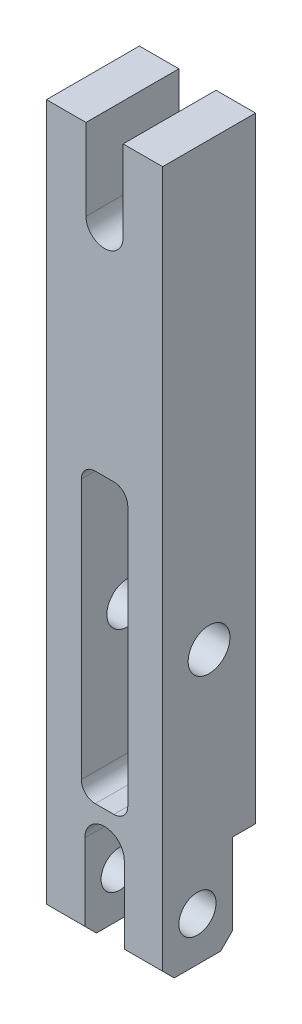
ISO-10303-21;
HEADER;
FILE_DESCRIPTION(('STEP AP214'),'2;1');
FILE_NAME('part.step','',(''),(''),'','','');
FILE_SCHEMA(('AUTOMOTIVE_DESIGN { 1 0 10303 214 1 1 1 1 }'));
ENDSEC;
DATA;
#1=APPLICATION_CONTEXT('core data for automotive mechanical design processes');
#2=APPLICATION_PROTOCOL_DEFINITION('international standard','automotive_design',2000,#1);
#3=PRODUCT_CONTEXT('',#1,'mechanical');
#4=PRODUCT('Part','Part','',(#3));
#5=PRODUCT_RELATED_PRODUCT_CATEGORY('part','',(#4));
#6=PRODUCT_DEFINITION_FORMATION('','',#4);
#7=PRODUCT_DEFINITION_CONTEXT('part definition',#1,'design');
#8=PRODUCT_DEFINITION('design','',#6,#7);
#9=PRODUCT_DEFINITION_SHAPE('','',#8);
#10=(LENGTH_UNIT() NAMED_UNIT(*) SI_UNIT(.MILLI.,.METRE.));
#11=(NAMED_UNIT(*) PLANE_ANGLE_UNIT() SI_UNIT($,.RADIAN.));
#12=(NAMED_UNIT(*) SI_UNIT($,.STERADIAN.) SOLID_ANGLE_UNIT());
#13=UNCERTAINTY_MEASURE_WITH_UNIT(LENGTH_MEASURE(1.E-05),#10,'distance_accuracy_value','');
#14=(GEOMETRIC_REPRESENTATION_CONTEXT(3) GLOBAL_UNCERTAINTY_ASSIGNED_CONTEXT((#13)) GLOBAL_UNIT_ASSIGNED_CONTEXT((#10,
#11,#12)) REPRESENTATION_CONTEXT('',''));
#15=CARTESIAN_POINT('',(0.,0.,0.));
#16=DIRECTION('',(0.,0.,1.));
#17=DIRECTION('',(1.,0.,0.));
#18=AXIS2_PLACEMENT_3D('',#15,#16,#17);
#19=CARTESIAN_POINT('',(0.,-77.,40.));
#20=DIRECTION('',(0.,0.,1.));
#21=DIRECTION('',(1.,0.,0.));
#22=AXIS2_PLACEMENT_3D('',#19,#20,#21);
#23=PLANE('',#22);
#24=DIRECTION('',(0.,-1.,0.));
#25=VECTOR('',#24,1.);
#26=CARTESIAN_POINT('',(-25.,190.,40.));
#27=LINE('',#26,#25);
#28=CARTESIAN_POINT('',(-25.,190.,40.));
#29=VERTEX_POINT('',#28);
#30=CARTESIAN_POINT('',(-25.,-110.,40.));
#31=VERTEX_POINT('',#30);
#32=EDGE_CURVE('E327',#29,#31,#27,.T.);
#33=ORIENTED_EDGE('',*,*,#32,.T.);
#34=DIRECTION('',(1.,0.,0.));
#35=VECTOR('',#34,1.);
#36=CARTESIAN_POINT('',(-8.49999999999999,-110.,40.));
#37=LINE('',#36,#35);
#38=CARTESIAN_POINT('',(-8.49999999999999,-110.,40.));
#39=VERTEX_POINT('',#38);
#40=EDGE_CURVE('E11',#31,#39,#37,.T.);
#41=ORIENTED_EDGE('',*,*,#40,.T.);
#42=DIRECTION('',(0.,1.,0.));
#43=VECTOR('',#42,1.);
#44=CARTESIAN_POINT('',(-8.50000000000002,-77.,40.));
#45=LINE('',#44,#43);
#46=CARTESIAN_POINT('',(-8.5,-77.,40.));
#47=VERTEX_POINT('',#46);
#48=EDGE_CURVE('E330',#39,#47,#45,.T.);
#49=ORIENTED_EDGE('',*,*,#48,.T.);
#50=CARTESIAN_POINT('',(0.,-77.,40.));
#51=DIRECTION('',(0.,0.,-1.));
#52=DIRECTION('',(1.,0.,0.));
#53=AXIS2_PLACEMENT_3D('',#50,#51,#52);
#54=CIRCLE('',#53,8.5);
#55=CARTESIAN_POINT('',(8.49999999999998,-77.,40.));
#56=VERTEX_POINT('',#55);
#57=EDGE_CURVE('E333',#47,#56,#54,.T.);
#58=ORIENTED_EDGE('',*,*,#57,.T.);
#59=DIRECTION('',(0.,-1.,0.));
#60=VECTOR('',#59,1.);
#61=CARTESIAN_POINT('',(8.49999999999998,-77.,40.));
#62=LINE('',#61,#60);
#63=CARTESIAN_POINT('',(8.50000000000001,-110.,40.));
#64=VERTEX_POINT('',#63);
#65=EDGE_CURVE('E335',#56,#64,#62,.T.);
#66=ORIENTED_EDGE('',*,*,#65,.T.);
#67=DIRECTION('',(1.,0.,0.));
#68=VECTOR('',#67,1.);
#69=CARTESIAN_POINT('',(25.,-110.,40.));
#70=LINE('',#69,#68);
#71=CARTESIAN_POINT('',(25.,-110.,40.));
#72=VERTEX_POINT('',#71);
#73=EDGE_CURVE('E40',#64,#72,#70,.T.);
#74=ORIENTED_EDGE('',*,*,#73,.T.);
#75=DIRECTION('',(0.,1.,0.));
#76=VECTOR('',#75,1.);
#77=CARTESIAN_POINT('',(25.,190.,40.));
#78=LINE('',#77,#76);
#79=CARTESIAN_POINT('',(25.,190.,40.));
#80=VERTEX_POINT('',#79);
#81=EDGE_CURVE('E337',#72,#80,#78,.T.);
#82=ORIENTED_EDGE('',*,*,#81,.T.);
#83=DIRECTION('',(-1.,0.,0.));
#84=VECTOR('',#83,1.);
#85=CARTESIAN_POINT('',(8.00000000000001,190.,40.));
#86=LINE('',#85,#84);
#87=CARTESIAN_POINT('',(8.00000000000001,190.,40.));
#88=VERTEX_POINT('',#87);
#89=EDGE_CURVE('E339',#80,#88,#86,.T.);
#90=ORIENTED_EDGE('',*,*,#89,.T.);
#91=DIRECTION('',(0.,-1.,0.));
#92=VECTOR('',#91,1.);
#93=CARTESIAN_POINT('',(8.00000000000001,190.,40.));
#94=LINE('',#93,#92);
#95=CARTESIAN_POINT('',(8.,155.,40.));
#96=VERTEX_POINT('',#95);
#97=EDGE_CURVE('E341',#88,#96,#94,.T.);
#98=ORIENTED_EDGE('',*,*,#97,.T.);
#99=CARTESIAN_POINT('',(0.,155.,40.));
#100=DIRECTION('',(0.,0.,-1.));
#101=DIRECTION('',(1.,0.,0.));
#102=AXIS2_PLACEMENT_3D('',#99,#100,#101);
#103=CIRCLE('',#102,8.);
#104=CARTESIAN_POINT('',(-7.99999999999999,155.,40.));
#105=VERTEX_POINT('',#104);
#106=EDGE_CURVE('E343',#96,#105,#103,.T.);
#107=ORIENTED_EDGE('',*,*,#106,.T.);
#108=DIRECTION('',(0.,1.,0.));
#109=VECTOR('',#108,1.);
#110=CARTESIAN_POINT('',(-7.99999999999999,190.,40.));
#111=LINE('',#110,#109);
#112=CARTESIAN_POINT('',(-7.99999999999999,190.,40.));
#113=VERTEX_POINT('',#112);
#114=EDGE_CURVE('E345',#105,#113,#111,.T.);
#115=ORIENTED_EDGE('',*,*,#114,.T.);
#116=DIRECTION('',(-1.,0.,0.));
#117=VECTOR('',#116,1.);
#118=CARTESIAN_POINT('',(-25.,190.,40.));
#119=LINE('',#118,#117);
#120=EDGE_CURVE('E347',#113,#29,#119,.T.);
#121=ORIENTED_EDGE('',*,*,#120,.T.);
#122=EDGE_LOOP('',(#33,#41,#49,#58,#66,#74,#82,#90,#98,#107,#115,#121));
#123=FACE_BOUND('',#122,.T.);
#124=DIRECTION('',(1.,0.,0.));
#125=VECTOR('',#124,1.);
#126=CARTESIAN_POINT('',(-3.99999999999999,-62.,40.));
#127=LINE('',#126,#125);
#128=CARTESIAN_POINT('',(-3.99999999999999,-62.,40.));
#129=VERTEX_POINT('',#128);
#130=CARTESIAN_POINT('',(4.00000000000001,-62.,40.));
#131=VERTEX_POINT('',#130);
#132=EDGE_CURVE('E270',#129,#131,#127,.T.);
#133=ORIENTED_EDGE('',*,*,#132,.F.);
#134=CARTESIAN_POINT('',(-3.99999999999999,-56.,40.));
#135=DIRECTION('',(0.,0.,1.));
#136=DIRECTION('',(1.,0.,0.));
#137=AXIS2_PLACEMENT_3D('',#134,#135,#136);
#138=CIRCLE('',#137,6.);
#139=CARTESIAN_POINT('',(-9.99999999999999,-56.,40.));
#140=VERTEX_POINT('',#139);
#141=EDGE_CURVE('E268',#140,#129,#138,.T.);
#142=ORIENTED_EDGE('',*,*,#141,.F.);
#143=DIRECTION('',(0.,-1.,0.));
#144=VECTOR('',#143,1.);
#145=CARTESIAN_POINT('',(-10.,56.,40.));
#146=LINE('',#145,#144);
#147=CARTESIAN_POINT('',(-10.,56.,40.));
#148=VERTEX_POINT('',#147);
#149=EDGE_CURVE('E284',#148,#140,#146,.T.);
#150=ORIENTED_EDGE('',*,*,#149,.F.);
#151=CARTESIAN_POINT('',(-4.00000000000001,56.,40.));
#152=DIRECTION('',(0.,0.,1.));
#153=DIRECTION('',(1.,0.,0.));
#154=AXIS2_PLACEMENT_3D('',#151,#152,#153);
#155=CIRCLE('',#154,6.);
#156=CARTESIAN_POINT('',(-4.00000000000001,62.,40.));
#157=VERTEX_POINT('',#156);
#158=EDGE_CURVE('E281',#157,#148,#155,.T.);
#159=ORIENTED_EDGE('',*,*,#158,.F.);
#160=DIRECTION('',(-1.,0.,0.));
#161=VECTOR('',#160,1.);
#162=CARTESIAN_POINT('',(-4.00000000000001,62.,40.));
#163=LINE('',#162,#161);
#164=CARTESIAN_POINT('',(3.99999999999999,62.,40.));
#165=VERTEX_POINT('',#164);
#166=EDGE_CURVE('E279',#165,#157,#163,.T.);
#167=ORIENTED_EDGE('',*,*,#166,.F.);
#168=CARTESIAN_POINT('',(3.99999999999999,56.,40.));
#169=DIRECTION('',(0.,0.,1.));
#170=DIRECTION('',(-1.,0.,0.));
#171=AXIS2_PLACEMENT_3D('',#168,#169,#170);
#172=CIRCLE('',#171,6.);
#173=CARTESIAN_POINT('',(9.99999999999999,56.,40.));
#174=VERTEX_POINT('',#173);
#175=EDGE_CURVE('E277',#174,#165,#172,.T.);
#176=ORIENTED_EDGE('',*,*,#175,.F.);
#177=DIRECTION('',(0.,1.,0.));
#178=VECTOR('',#177,1.);
#179=CARTESIAN_POINT('',(9.99999999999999,56.,40.));
#180=LINE('',#179,#178);
#181=CARTESIAN_POINT('',(10.,-56.,40.));
#182=VERTEX_POINT('',#181);
#183=EDGE_CURVE('E275',#182,#174,#180,.T.);
#184=ORIENTED_EDGE('',*,*,#183,.F.);
#185=CARTESIAN_POINT('',(4.00000000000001,-56.,40.));
#186=DIRECTION('',(0.,0.,1.));
#187=DIRECTION('',(1.,0.,0.));
#188=AXIS2_PLACEMENT_3D('',#185,#186,#187);
#189=CIRCLE('',#188,6.);
#190=EDGE_CURVE('E273',#131,#182,#189,.T.);
#191=ORIENTED_EDGE('',*,*,#190,.F.);
#192=EDGE_LOOP('',(#133,#142,#150,#159,#167,#176,#184,#191));
#193=FACE_BOUND('',#192,.T.);
#194=ADVANCED_FACE('F32',(#123,#193),#23,.T.);
#195=CARTESIAN_POINT('',(0.,-77.,0.));
#196=DIRECTION('',(0.,0.,1.));
#197=DIRECTION('',(1.,0.,0.));
#198=AXIS2_PLACEMENT_3D('',#195,#196,#197);
#199=PLANE('',#198);
#200=DIRECTION('',(0.,1.,0.));
#201=VECTOR('',#200,1.);
#202=CARTESIAN_POINT('',(25.,190.,0.));
#203=LINE('',#202,#201);
#204=CARTESIAN_POINT('',(25.,-75.,0.));
#205=VERTEX_POINT('',#204);
#206=CARTESIAN_POINT('',(25.,190.,0.));
#207=VERTEX_POINT('',#206);
#208=EDGE_CURVE('E354',#205,#207,#203,.T.);
#209=ORIENTED_EDGE('',*,*,#208,.F.);
#210=DIRECTION('',(-1.,0.,0.));
#211=VECTOR('',#210,1.);
#212=CARTESIAN_POINT('',(0.,-75.,0.));
#213=LINE('',#212,#211);
#214=CARTESIAN_POINT('',(8.26135582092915,-75.,0.));
#215=VERTEX_POINT('',#214);
#216=EDGE_CURVE('E265',#205,#215,#213,.T.);
#217=ORIENTED_EDGE('',*,*,#216,.T.);
#218=CARTESIAN_POINT('',(0.,-77.,0.));
#219=DIRECTION('',(0.,0.,-1.));
#220=DIRECTION('',(1.,0.,0.));
#221=AXIS2_PLACEMENT_3D('',#218,#219,#220);
#222=CIRCLE('',#221,8.5);
#223=CARTESIAN_POINT('',(-8.26135582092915,-75.,0.));
#224=VERTEX_POINT('',#223);
#225=EDGE_CURVE('E351',#224,#215,#222,.T.);
#226=ORIENTED_EDGE('',*,*,#225,.F.);
#227=CARTESIAN_POINT('',(-25.,-75.,0.));
#228=VERTEX_POINT('',#227);
#229=EDGE_CURVE('E262',#224,#228,#213,.T.);
#230=ORIENTED_EDGE('',*,*,#229,.T.);
#231=DIRECTION('',(0.,-1.,0.));
#232=VECTOR('',#231,1.);
#233=CARTESIAN_POINT('',(-25.,190.,0.));
#234=LINE('',#233,#232);
#235=CARTESIAN_POINT('',(-25.,190.,0.));
#236=VERTEX_POINT('',#235);
#237=EDGE_CURVE('E247',#236,#228,#234,.T.);
#238=ORIENTED_EDGE('',*,*,#237,.F.);
#239=DIRECTION('',(-1.,0.,0.));
#240=VECTOR('',#239,1.);
#241=CARTESIAN_POINT('',(-25.,190.,0.));
#242=LINE('',#241,#240);
#243=CARTESIAN_POINT('',(-7.99999999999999,190.,0.));
#244=VERTEX_POINT('',#243);
#245=EDGE_CURVE('E331',#244,#236,#242,.T.);
#246=ORIENTED_EDGE('',*,*,#245,.F.);
#247=DIRECTION('',(0.,1.,0.));
#248=VECTOR('',#247,1.);
#249=CARTESIAN_POINT('',(-7.99999999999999,190.,0.));
#250=LINE('',#249,#248);
#251=CARTESIAN_POINT('',(-7.99999999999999,155.,0.));
#252=VERTEX_POINT('',#251);
#253=EDGE_CURVE('E362',#252,#244,#250,.T.);
#254=ORIENTED_EDGE('',*,*,#253,.F.);
#255=CARTESIAN_POINT('',(0.,155.,0.));
#256=DIRECTION('',(0.,0.,-1.));
#257=DIRECTION('',(1.,0.,0.));
#258=AXIS2_PLACEMENT_3D('',#255,#256,#257);
#259=CIRCLE('',#258,8.);
#260=CARTESIAN_POINT('',(8.,155.,0.));
#261=VERTEX_POINT('',#260);
#262=EDGE_CURVE('E360',#261,#252,#259,.T.);
#263=ORIENTED_EDGE('',*,*,#262,.F.);
#264=DIRECTION('',(0.,-1.,0.));
#265=VECTOR('',#264,1.);
#266=CARTESIAN_POINT('',(8.00000000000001,190.,0.));
#267=LINE('',#266,#265);
#268=CARTESIAN_POINT('',(8.00000000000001,190.,0.));
#269=VERTEX_POINT('',#268);
#270=EDGE_CURVE('E358',#269,#261,#267,.T.);
#271=ORIENTED_EDGE('',*,*,#270,.F.);
#272=DIRECTION('',(-1.,0.,0.));
#273=VECTOR('',#272,1.);
#274=CARTESIAN_POINT('',(8.00000000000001,190.,0.));
#275=LINE('',#274,#273);
#276=EDGE_CURVE('E356',#207,#269,#275,.T.);
#277=ORIENTED_EDGE('',*,*,#276,.F.);
#278=EDGE_LOOP('',(#209,#217,#226,#230,#238,#246,#254,#263,#271,#277));
#279=FACE_BOUND('',#278,.T.);
#280=CARTESIAN_POINT('',(-3.99999999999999,-56.,0.));
#281=DIRECTION('',(0.,0.,1.));
#282=DIRECTION('',(1.,0.,0.));
#283=AXIS2_PLACEMENT_3D('',#280,#281,#282);
#284=CIRCLE('',#283,6.);
#285=CARTESIAN_POINT('',(-9.99999999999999,-56.,0.));
#286=VERTEX_POINT('',#285);
#287=CARTESIAN_POINT('',(-3.99999999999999,-62.,0.));
#288=VERTEX_POINT('',#287);
#289=EDGE_CURVE('E287',#286,#288,#284,.T.);
#290=ORIENTED_EDGE('',*,*,#289,.T.);
#291=DIRECTION('',(1.,0.,0.));
#292=VECTOR('',#291,1.);
#293=CARTESIAN_POINT('',(-3.99999999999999,-62.,0.));
#294=LINE('',#293,#292);
#295=CARTESIAN_POINT('',(4.00000000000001,-62.,0.));
#296=VERTEX_POINT('',#295);
#297=EDGE_CURVE('E290',#288,#296,#294,.T.);
#298=ORIENTED_EDGE('',*,*,#297,.T.);
#299=CARTESIAN_POINT('',(4.00000000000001,-56.,0.));
#300=DIRECTION('',(0.,0.,1.));
#301=DIRECTION('',(1.,0.,0.));
#302=AXIS2_PLACEMENT_3D('',#299,#300,#301);
#303=CIRCLE('',#302,6.);
#304=CARTESIAN_POINT('',(10.,-56.,0.));
#305=VERTEX_POINT('',#304);
#306=EDGE_CURVE('E293',#296,#305,#303,.T.);
#307=ORIENTED_EDGE('',*,*,#306,.T.);
#308=DIRECTION('',(0.,1.,0.));
#309=VECTOR('',#308,1.);
#310=CARTESIAN_POINT('',(9.99999999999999,56.,0.));
#311=LINE('',#310,#309);
#312=CARTESIAN_POINT('',(9.99999999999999,56.,0.));
#313=VERTEX_POINT('',#312);
#314=EDGE_CURVE('E296',#305,#313,#311,.T.);
#315=ORIENTED_EDGE('',*,*,#314,.T.);
#316=CARTESIAN_POINT('',(3.99999999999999,56.,0.));
#317=DIRECTION('',(0.,0.,1.));
#318=DIRECTION('',(-1.,0.,0.));
#319=AXIS2_PLACEMENT_3D('',#316,#317,#318);
#320=CIRCLE('',#319,6.);
#321=CARTESIAN_POINT('',(3.99999999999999,62.,0.));
#322=VERTEX_POINT('',#321);
#323=EDGE_CURVE('E299',#313,#322,#320,.T.);
#324=ORIENTED_EDGE('',*,*,#323,.T.);
#325=DIRECTION('',(-1.,0.,0.));
#326=VECTOR('',#325,1.);
#327=CARTESIAN_POINT('',(-4.00000000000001,62.,0.));
#328=LINE('',#327,#326);
#329=CARTESIAN_POINT('',(-4.00000000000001,62.,0.));
#330=VERTEX_POINT('',#329);
#331=EDGE_CURVE('E302',#322,#330,#328,.T.);
#332=ORIENTED_EDGE('',*,*,#331,.T.);
#333=CARTESIAN_POINT('',(-4.00000000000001,56.,0.));
#334=DIRECTION('',(0.,0.,1.));
#335=DIRECTION('',(1.,0.,0.));
#336=AXIS2_PLACEMENT_3D('',#333,#334,#335);
#337=CIRCLE('',#336,6.);
#338=CARTESIAN_POINT('',(-10.,56.,0.));
#339=VERTEX_POINT('',#338);
#340=EDGE_CURVE('E305',#330,#339,#337,.T.);
#341=ORIENTED_EDGE('',*,*,#340,.T.);
#342=DIRECTION('',(0.,-1.,0.));
#343=VECTOR('',#342,1.);
#344=CARTESIAN_POINT('',(-10.,56.,0.));
#345=LINE('',#344,#343);
#346=EDGE_CURVE('E271',#339,#286,#345,.T.);
#347=ORIENTED_EDGE('',*,*,#346,.T.);
#348=EDGE_LOOP('',(#290,#298,#307,#315,#324,#332,#341,#347));
#349=FACE_BOUND('',#348,.T.);
#350=ADVANCED_FACE('F499',(#279,#349),#199,.F.);
#351=CARTESIAN_POINT('',(-25.,190.,40.));
#352=DIRECTION('',(1.,0.,0.));
#353=DIRECTION('',(0.,1.,0.));
#354=AXIS2_PLACEMENT_3D('',#351,#352,#353);
#355=PLANE('',#354);
#356=CARTESIAN_POINT('',(-25.,0.,20.));
#357=DIRECTION('',(-1.,0.,0.));
#358=DIRECTION('',(0.,-1.,0.));
#359=AXIS2_PLACEMENT_3D('',#356,#357,#358);
#360=CIRCLE('',#359,9.00000000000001);
#361=CARTESIAN_POINT('',(-25.,-9.00000000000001,20.));
#362=VERTEX_POINT('',#361);
#363=EDGE_CURVE('E797',#362,#362,#360,.T.);
#364=ORIENTED_EDGE('',*,*,#363,.F.);
#365=EDGE_LOOP('',(#364));
#366=FACE_BOUND('',#365,.T.);
#367=CARTESIAN_POINT('',(-25.,-96.,25.));
#368=DIRECTION('',(-1.,0.,0.));
#369=DIRECTION('',(0.,-1.,0.));
#370=AXIS2_PLACEMENT_3D('',#367,#368,#369);
#371=CIRCLE('',#370,8.);
#372=CARTESIAN_POINT('',(-25.,-104.,25.));
#373=VERTEX_POINT('',#372);
#374=EDGE_CURVE('E532',#373,#373,#371,.T.);
#375=ORIENTED_EDGE('',*,*,#374,.F.);
#376=EDGE_LOOP('',(#375));
#377=FACE_BOUND('',#376,.T.);
#378=DIRECTION('',(0.,1.,0.));
#379=VECTOR('',#378,1.);
#380=CARTESIAN_POINT('',(-25.,-75.,10.));
#381=LINE('',#380,#379);
#382=CARTESIAN_POINT('',(-25.,-110.,10.));
#383=VERTEX_POINT('',#382);
#384=CARTESIAN_POINT('',(-25.,-75.,10.));
#385=VERTEX_POINT('',#384);
#386=EDGE_CURVE('E219',#383,#385,#381,.T.);
#387=ORIENTED_EDGE('',*,*,#386,.F.);
#388=DIRECTION('',(0.,0.707106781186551,-0.707106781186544));
#389=VECTOR('',#388,1.);
#390=CARTESIAN_POINT('',(-25.,-115.,15.));
#391=LINE('',#390,#389);
#392=CARTESIAN_POINT('',(-25.,-115.,15.));
#393=VERTEX_POINT('',#392);
#394=EDGE_CURVE('E418',#383,#393,#391,.F.);
#395=ORIENTED_EDGE('',*,*,#394,.T.);
#396=DIRECTION('',(0.,0.,-1.));
#397=VECTOR('',#396,1.);
#398=CARTESIAN_POINT('',(-25.,-115.,40.));
#399=LINE('',#398,#397);
#400=CARTESIAN_POINT('',(-25.,-115.,35.));
#401=VERTEX_POINT('',#400);
#402=EDGE_CURVE('E396',#401,#393,#399,.T.);
#403=ORIENTED_EDGE('',*,*,#402,.F.);
#404=DIRECTION('',(0.,0.707106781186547,0.707106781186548));
#405=VECTOR('',#404,1.);
#406=CARTESIAN_POINT('',(-25.,-110.,40.));
#407=LINE('',#406,#405);
#408=EDGE_CURVE('E416',#401,#31,#407,.T.);
#409=ORIENTED_EDGE('',*,*,#408,.T.);
#410=ORIENTED_EDGE('',*,*,#32,.F.);
#411=DIRECTION('',(0.,0.,-1.));
#412=VECTOR('',#411,1.);
#413=CARTESIAN_POINT('',(-25.,190.,40.));
#414=LINE('',#413,#412);
#415=EDGE_CURVE('E349',#29,#236,#414,.T.);
#416=ORIENTED_EDGE('',*,*,#415,.T.);
#417=ORIENTED_EDGE('',*,*,#237,.T.);
#418=DIRECTION('',(0.,0.,-1.));
#419=VECTOR('',#418,1.);
#420=CARTESIAN_POINT('',(-25.,-75.,-20.));
#421=LINE('',#420,#419);
#422=EDGE_CURVE('E231',#385,#228,#421,.T.);
#423=ORIENTED_EDGE('',*,*,#422,.F.);
#424=EDGE_LOOP('',(#387,#395,#403,#409,#410,#416,#417,#423));
#425=FACE_BOUND('',#424,.T.);
#426=ADVANCED_FACE('F244',(#366,#377,#425),#355,.F.);
#427=CARTESIAN_POINT('',(-25.,-115.,40.));
#428=DIRECTION('',(0.,1.,0.));
#429=DIRECTION('',(-1.,0.,0.));
#430=AXIS2_PLACEMENT_3D('',#427,#428,#429);
#431=PLANE('',#430);
#432=ORIENTED_EDGE('',*,*,#402,.T.);
#433=DIRECTION('',(1.,0.,0.));
#434=VECTOR('',#433,1.);
#435=CARTESIAN_POINT('',(-25.,-115.,15.));
#436=LINE('',#435,#434);
#437=CARTESIAN_POINT('',(-8.49999999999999,-115.,15.));
#438=VERTEX_POINT('',#437);
#439=EDGE_CURVE('E408',#393,#438,#436,.T.);
#440=ORIENTED_EDGE('',*,*,#439,.T.);
#441=DIRECTION('',(0.,0.,-1.));
#442=VECTOR('',#441,1.);
#443=CARTESIAN_POINT('',(-8.49999999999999,-115.,40.));
#444=LINE('',#443,#442);
#445=CARTESIAN_POINT('',(-8.49999999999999,-115.,35.));
#446=VERTEX_POINT('',#445);
#447=EDGE_CURVE('E393',#446,#438,#444,.T.);
#448=ORIENTED_EDGE('',*,*,#447,.F.);
#449=DIRECTION('',(-1.,0.,0.));
#450=VECTOR('',#449,1.);
#451=CARTESIAN_POINT('',(-25.,-115.,35.));
#452=LINE('',#451,#450);
#453=EDGE_CURVE('E401',#446,#401,#452,.T.);
#454=ORIENTED_EDGE('',*,*,#453,.T.);
#455=EDGE_LOOP('',(#432,#440,#448,#454));
#456=FACE_BOUND('',#455,.T.);
#457=ADVANCED_FACE('F782',(#456),#431,.F.);
#458=CARTESIAN_POINT('',(-8.50000000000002,-77.,40.));
#459=DIRECTION('',(-1.,0.,0.));
#460=DIRECTION('',(0.,-1.,0.));
#461=AXIS2_PLACEMENT_3D('',#458,#459,#460);
#462=PLANE('',#461);
#463=CARTESIAN_POINT('',(-8.50000000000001,-96.,25.));
#464=DIRECTION('',(-1.,0.,0.));
#465=DIRECTION('',(0.,-1.,0.));
#466=AXIS2_PLACEMENT_3D('',#463,#464,#465);
#467=CIRCLE('',#466,8.);
#468=CARTESIAN_POINT('',(-8.5,-104.,25.));
#469=VERTEX_POINT('',#468);
#470=EDGE_CURVE('E232',#469,#469,#467,.T.);
#471=ORIENTED_EDGE('',*,*,#470,.T.);
#472=EDGE_LOOP('',(#471));
#473=FACE_BOUND('',#472,.T.);
#474=ORIENTED_EDGE('',*,*,#447,.T.);
#475=DIRECTION('',(0.,-0.707106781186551,0.707106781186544));
#476=VECTOR('',#475,1.);
#477=CARTESIAN_POINT('',(-8.49999999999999,-115.,14.9999999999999));
#478=LINE('',#477,#476);
#479=CARTESIAN_POINT('',(-8.49999999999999,-110.,10.));
#480=VERTEX_POINT('',#479);
#481=EDGE_CURVE('E413',#438,#480,#478,.F.);
#482=ORIENTED_EDGE('',*,*,#481,.T.);
#483=DIRECTION('',(0.,1.,0.));
#484=VECTOR('',#483,1.);
#485=CARTESIAN_POINT('',(-8.50000000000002,-77.,10.));
#486=LINE('',#485,#484);
#487=CARTESIAN_POINT('',(-8.5,-77.,10.));
#488=VERTEX_POINT('',#487);
#489=EDGE_CURVE('E259',#480,#488,#486,.T.);
#490=ORIENTED_EDGE('',*,*,#489,.T.);
#491=DIRECTION('',(0.,0.,-1.));
#492=VECTOR('',#491,1.);
#493=CARTESIAN_POINT('',(-8.5,-77.,40.));
#494=LINE('',#493,#492);
#495=EDGE_CURVE('E390',#47,#488,#494,.T.);
#496=ORIENTED_EDGE('',*,*,#495,.F.);
#497=ORIENTED_EDGE('',*,*,#48,.F.);
#498=DIRECTION('',(0.,-0.707106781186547,-0.707106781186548));
#499=VECTOR('',#498,1.);
#500=CARTESIAN_POINT('',(-8.49999999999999,-110.,40.));
#501=LINE('',#500,#499);
#502=EDGE_CURVE('E411',#39,#446,#501,.T.);
#503=ORIENTED_EDGE('',*,*,#502,.T.);
#504=EDGE_LOOP('',(#474,#482,#490,#496,#497,#503));
#505=FACE_BOUND('',#504,.T.);
#506=ADVANCED_FACE('F478',(#473,#505),#462,.F.);
#507=CARTESIAN_POINT('',(0.,-77.,40.));
#508=DIRECTION('',(0.,0.,-1.));
#509=DIRECTION('',(-1.,0.,0.));
#510=AXIS2_PLACEMENT_3D('',#507,#508,#509);
#511=CYLINDRICAL_SURFACE('',#510,8.5);
#512=ORIENTED_EDGE('',*,*,#225,.T.);
#513=DIRECTION('',(0.,0.,-1.));
#514=VECTOR('',#513,1.);
#515=CARTESIAN_POINT('',(8.26135582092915,-75.,40.));
#516=LINE('',#515,#514);
#517=CARTESIAN_POINT('',(8.26135582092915,-75.,10.));
#518=VERTEX_POINT('',#517);
#519=EDGE_CURVE('E264',#215,#518,#516,.F.);
#520=ORIENTED_EDGE('',*,*,#519,.T.);
#521=CARTESIAN_POINT('',(0.,-77.,10.));
#522=DIRECTION('',(0.,0.,1.));
#523=DIRECTION('',(0.,-1.,0.));
#524=AXIS2_PLACEMENT_3D('',#521,#522,#523);
#525=CIRCLE('',#524,8.5);
#526=CARTESIAN_POINT('',(8.49999999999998,-77.,10.));
#527=VERTEX_POINT('',#526);
#528=EDGE_CURVE('E255',#518,#527,#525,.F.);
#529=ORIENTED_EDGE('',*,*,#528,.T.);
#530=DIRECTION('',(0.,0.,-1.));
#531=VECTOR('',#530,1.);
#532=CARTESIAN_POINT('',(8.49999999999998,-77.,40.));
#533=LINE('',#532,#531);
#534=EDGE_CURVE('E387',#56,#527,#533,.T.);
#535=ORIENTED_EDGE('',*,*,#534,.F.);
#536=ORIENTED_EDGE('',*,*,#57,.F.);
#537=ORIENTED_EDGE('',*,*,#495,.T.);
#538=CARTESIAN_POINT('',(-8.26135582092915,-75.,10.));
#539=VERTEX_POINT('',#538);
#540=EDGE_CURVE('E258',#488,#539,#525,.F.);
#541=ORIENTED_EDGE('',*,*,#540,.T.);
#542=DIRECTION('',(0.,0.,-1.));
#543=VECTOR('',#542,1.);
#544=CARTESIAN_POINT('',(-8.26135582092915,-75.,40.));
#545=LINE('',#544,#543);
#546=EDGE_CURVE('E238',#539,#224,#545,.T.);
#547=ORIENTED_EDGE('',*,*,#546,.T.);
#548=EDGE_LOOP('',(#512,#520,#529,#535,#536,#537,#541,#547));
#549=FACE_BOUND('',#548,.T.);
#550=ADVANCED_FACE('F483',(#549),#511,.F.);
#551=CARTESIAN_POINT('',(8.49999999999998,-77.,40.));
#552=DIRECTION('',(1.,0.,0.));
#553=DIRECTION('',(0.,1.,0.));
#554=AXIS2_PLACEMENT_3D('',#551,#552,#553);
#555=PLANE('',#554);
#556=CARTESIAN_POINT('',(8.5,-96.,25.));
#557=DIRECTION('',(1.,0.,0.));
#558=DIRECTION('',(0.,1.,0.));
#559=AXIS2_PLACEMENT_3D('',#556,#557,#558);
#560=CIRCLE('',#559,8.);
#561=CARTESIAN_POINT('',(8.49999999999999,-88.,25.));
#562=VERTEX_POINT('',#561);
#563=EDGE_CURVE('E531',#562,#562,#560,.T.);
#564=ORIENTED_EDGE('',*,*,#563,.T.);
#565=EDGE_LOOP('',(#564));
#566=FACE_BOUND('',#565,.T.);
#567=DIRECTION('',(0.,-1.,0.));
#568=VECTOR('',#567,1.);
#569=CARTESIAN_POINT('',(8.49999999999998,-77.,10.));
#570=LINE('',#569,#568);
#571=CARTESIAN_POINT('',(8.50000000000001,-110.,10.));
#572=VERTEX_POINT('',#571);
#573=EDGE_CURVE('E253',#527,#572,#570,.T.);
#574=ORIENTED_EDGE('',*,*,#573,.T.);
#575=DIRECTION('',(0.,0.707106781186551,-0.707106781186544));
#576=VECTOR('',#575,1.);
#577=CARTESIAN_POINT('',(8.50000000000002,-115.,15.));
#578=LINE('',#577,#576);
#579=CARTESIAN_POINT('',(8.50000000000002,-115.,15.));
#580=VERTEX_POINT('',#579);
#581=EDGE_CURVE('E431',#572,#580,#578,.F.);
#582=ORIENTED_EDGE('',*,*,#581,.T.);
#583=DIRECTION('',(0.,0.,-1.));
#584=VECTOR('',#583,1.);
#585=CARTESIAN_POINT('',(8.50000000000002,-115.,40.));
#586=LINE('',#585,#584);
#587=CARTESIAN_POINT('',(8.50000000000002,-115.,35.));
#588=VERTEX_POINT('',#587);
#589=EDGE_CURVE('E384',#588,#580,#586,.T.);
#590=ORIENTED_EDGE('',*,*,#589,.F.);
#591=DIRECTION('',(0.,0.707106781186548,0.707106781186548));
#592=VECTOR('',#591,1.);
#593=CARTESIAN_POINT('',(8.50000000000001,-110.,40.));
#594=LINE('',#593,#592);
#595=EDGE_CURVE('E47',#588,#64,#594,.T.);
#596=ORIENTED_EDGE('',*,*,#595,.T.);
#597=ORIENTED_EDGE('',*,*,#65,.F.);
#598=ORIENTED_EDGE('',*,*,#534,.T.);
#599=EDGE_LOOP('',(#574,#582,#590,#596,#597,#598));
#600=FACE_BOUND('',#599,.T.);
#601=ADVANCED_FACE('F484',(#566,#600),#555,.F.);
#602=CARTESIAN_POINT('',(8.50000000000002,-115.,40.));
#603=DIRECTION('',(0.,1.,0.));
#604=DIRECTION('',(0.,0.,1.));
#605=AXIS2_PLACEMENT_3D('',#602,#603,#604);
#606=PLANE('',#605);
#607=ORIENTED_EDGE('',*,*,#589,.T.);
#608=DIRECTION('',(1.,0.,0.));
#609=VECTOR('',#608,1.);
#610=CARTESIAN_POINT('',(8.50000000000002,-115.,15.));
#611=LINE('',#610,#609);
#612=CARTESIAN_POINT('',(25.,-115.,15.));
#613=VERTEX_POINT('',#612);
#614=EDGE_CURVE('E422',#580,#613,#611,.T.);
#615=ORIENTED_EDGE('',*,*,#614,.T.);
#616=DIRECTION('',(0.,0.,-1.));
#617=VECTOR('',#616,1.);
#618=CARTESIAN_POINT('',(25.,-115.,40.));
#619=LINE('',#618,#617);
#620=CARTESIAN_POINT('',(25.,-115.,35.));
#621=VERTEX_POINT('',#620);
#622=EDGE_CURVE('E381',#621,#613,#619,.T.);
#623=ORIENTED_EDGE('',*,*,#622,.F.);
#624=DIRECTION('',(-1.,0.,0.));
#625=VECTOR('',#624,1.);
#626=CARTESIAN_POINT('',(8.50000000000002,-115.,35.));
#627=LINE('',#626,#625);
#628=EDGE_CURVE('E420',#621,#588,#627,.T.);
#629=ORIENTED_EDGE('',*,*,#628,.T.);
#630=EDGE_LOOP('',(#607,#615,#623,#629));
#631=FACE_BOUND('',#630,.T.);
#632=ADVANCED_FACE('F487',(#631),#606,.F.);
#633=CARTESIAN_POINT('',(25.,190.,40.));
#634=DIRECTION('',(-1.,0.,0.));
#635=DIRECTION('',(0.,-1.,0.));
#636=AXIS2_PLACEMENT_3D('',#633,#634,#635);
#637=PLANE('',#636);
#638=CARTESIAN_POINT('',(25.0000000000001,0.,20.));
#639=DIRECTION('',(-1.,0.,0.));
#640=DIRECTION('',(0.,-1.,0.));
#641=AXIS2_PLACEMENT_3D('',#638,#639,#640);
#642=CIRCLE('',#641,9.00000000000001);
#643=CARTESIAN_POINT('',(25.0000000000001,-9.,20.));
#644=VERTEX_POINT('',#643);
#645=EDGE_CURVE('E406',#644,#644,#642,.T.);
#646=ORIENTED_EDGE('',*,*,#645,.T.);
#647=EDGE_LOOP('',(#646));
#648=FACE_BOUND('',#647,.T.);
#649=CARTESIAN_POINT('',(25.0000000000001,-96.,25.));
#650=DIRECTION('',(-1.,0.,0.));
#651=DIRECTION('',(0.,-1.,0.));
#652=AXIS2_PLACEMENT_3D('',#649,#650,#651);
#653=CIRCLE('',#652,8.);
#654=CARTESIAN_POINT('',(25.0000000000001,-104.,25.));
#655=VERTEX_POINT('',#654);
#656=EDGE_CURVE('E529',#655,#655,#653,.T.);
#657=ORIENTED_EDGE('',*,*,#656,.T.);
#658=EDGE_LOOP('',(#657));
#659=FACE_BOUND('',#658,.T.);
#660=ORIENTED_EDGE('',*,*,#622,.T.);
#661=DIRECTION('',(0.,-0.707106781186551,0.707106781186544));
#662=VECTOR('',#661,1.);
#663=CARTESIAN_POINT('',(25.,-115.,15.));
#664=LINE('',#663,#662);
#665=CARTESIAN_POINT('',(25.,-110.,10.));
#666=VERTEX_POINT('',#665);
#667=EDGE_CURVE('E427',#613,#666,#664,.F.);
#668=ORIENTED_EDGE('',*,*,#667,.T.);
#669=DIRECTION('',(0.,1.,0.));
#670=VECTOR('',#669,1.);
#671=CARTESIAN_POINT('',(25.,190.,9.99999999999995));
#672=LINE('',#671,#670);
#673=CARTESIAN_POINT('',(25.,-75.,10.));
#674=VERTEX_POINT('',#673);
#675=EDGE_CURVE('E399',#666,#674,#672,.T.);
#676=ORIENTED_EDGE('',*,*,#675,.T.);
#677=DIRECTION('',(0.,0.,-1.));
#678=VECTOR('',#677,1.);
#679=CARTESIAN_POINT('',(25.,-75.,-20.));
#680=LINE('',#679,#678);
#681=EDGE_CURVE('E241',#674,#205,#680,.T.);
#682=ORIENTED_EDGE('',*,*,#681,.T.);
#683=ORIENTED_EDGE('',*,*,#208,.T.);
#684=DIRECTION('',(0.,0.,-1.));
#685=VECTOR('',#684,1.);
#686=CARTESIAN_POINT('',(25.,190.,40.));
#687=LINE('',#686,#685);
#688=EDGE_CURVE('E378',#80,#207,#687,.T.);
#689=ORIENTED_EDGE('',*,*,#688,.F.);
#690=ORIENTED_EDGE('',*,*,#81,.F.);
#691=DIRECTION('',(0.,-0.707106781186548,-0.707106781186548));
#692=VECTOR('',#691,1.);
#693=CARTESIAN_POINT('',(25.,-110.,40.));
#694=LINE('',#693,#692);
#695=EDGE_CURVE('E425',#72,#621,#694,.T.);
#696=ORIENTED_EDGE('',*,*,#695,.T.);
#697=EDGE_LOOP('',(#660,#668,#676,#682,#683,#689,#690,#696));
#698=FACE_BOUND('',#697,.T.);
#699=ADVANCED_FACE('F440',(#648,#659,#698),#637,.F.);
#700=CARTESIAN_POINT('',(8.00000000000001,190.,40.));
#701=DIRECTION('',(0.,-1.,0.));
#702=DIRECTION('',(0.,0.,-1.));
#703=AXIS2_PLACEMENT_3D('',#700,#701,#702);
#704=PLANE('',#703);
#705=ORIENTED_EDGE('',*,*,#276,.T.);
#706=DIRECTION('',(0.,0.,-1.));
#707=VECTOR('',#706,1.);
#708=CARTESIAN_POINT('',(8.00000000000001,190.,40.));
#709=LINE('',#708,#707);
#710=EDGE_CURVE('E375',#88,#269,#709,.T.);
#711=ORIENTED_EDGE('',*,*,#710,.F.);
#712=ORIENTED_EDGE('',*,*,#89,.F.);
#713=ORIENTED_EDGE('',*,*,#688,.T.);
#714=EDGE_LOOP('',(#705,#711,#712,#713));
#715=FACE_BOUND('',#714,.T.);
#716=ADVANCED_FACE('F447',(#715),#704,.F.);
#717=CARTESIAN_POINT('',(8.00000000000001,190.,40.));
#718=DIRECTION('',(1.,0.,0.));
#719=DIRECTION('',(0.,1.,0.));
#720=AXIS2_PLACEMENT_3D('',#717,#718,#719);
#721=PLANE('',#720);
#722=ORIENTED_EDGE('',*,*,#270,.T.);
#723=DIRECTION('',(0.,0.,-1.));
#724=VECTOR('',#723,1.);
#725=CARTESIAN_POINT('',(8.,155.,40.));
#726=LINE('',#725,#724);
#727=EDGE_CURVE('E372',#96,#261,#726,.T.);
#728=ORIENTED_EDGE('',*,*,#727,.F.);
#729=ORIENTED_EDGE('',*,*,#97,.F.);
#730=ORIENTED_EDGE('',*,*,#710,.T.);
#731=EDGE_LOOP('',(#722,#728,#729,#730));
#732=FACE_BOUND('',#731,.T.);
#733=ADVANCED_FACE('F453',(#732),#721,.F.);
#734=CARTESIAN_POINT('',(0.,155.,40.));
#735=DIRECTION('',(0.,0.,-1.));
#736=DIRECTION('',(-1.,0.,0.));
#737=AXIS2_PLACEMENT_3D('',#734,#735,#736);
#738=CYLINDRICAL_SURFACE('',#737,8.);
#739=ORIENTED_EDGE('',*,*,#262,.T.);
#740=DIRECTION('',(0.,0.,-1.));
#741=VECTOR('',#740,1.);
#742=CARTESIAN_POINT('',(-7.99999999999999,155.,40.));
#743=LINE('',#742,#741);
#744=EDGE_CURVE('E369',#105,#252,#743,.T.);
#745=ORIENTED_EDGE('',*,*,#744,.F.);
#746=ORIENTED_EDGE('',*,*,#106,.F.);
#747=ORIENTED_EDGE('',*,*,#727,.T.);
#748=EDGE_LOOP('',(#739,#745,#746,#747));
#749=FACE_BOUND('',#748,.T.);
#750=ADVANCED_FACE('F457',(#749),#738,.F.);
#751=CARTESIAN_POINT('',(-7.99999999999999,190.,40.));
#752=DIRECTION('',(-1.,0.,0.));
#753=DIRECTION('',(0.,-1.,0.));
#754=AXIS2_PLACEMENT_3D('',#751,#752,#753);
#755=PLANE('',#754);
#756=ORIENTED_EDGE('',*,*,#253,.T.);
#757=DIRECTION('',(0.,0.,-1.));
#758=VECTOR('',#757,1.);
#759=CARTESIAN_POINT('',(-7.99999999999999,190.,40.));
#760=LINE('',#759,#758);
#761=EDGE_CURVE('E366',#113,#244,#760,.T.);
#762=ORIENTED_EDGE('',*,*,#761,.F.);
#763=ORIENTED_EDGE('',*,*,#114,.F.);
#764=ORIENTED_EDGE('',*,*,#744,.T.);
#765=EDGE_LOOP('',(#756,#762,#763,#764));
#766=FACE_BOUND('',#765,.T.);
#767=ADVANCED_FACE('F462',(#766),#755,.F.);
#768=CARTESIAN_POINT('',(-25.,190.,40.));
#769=DIRECTION('',(0.,-1.,0.));
#770=DIRECTION('',(0.,0.,-1.));
#771=AXIS2_PLACEMENT_3D('',#768,#769,#770);
#772=PLANE('',#771);
#773=ORIENTED_EDGE('',*,*,#245,.T.);
#774=ORIENTED_EDGE('',*,*,#415,.F.);
#775=ORIENTED_EDGE('',*,*,#120,.F.);
#776=ORIENTED_EDGE('',*,*,#761,.T.);
#777=EDGE_LOOP('',(#773,#774,#775,#776));
#778=FACE_BOUND('',#777,.T.);
#779=ADVANCED_FACE('F468',(#778),#772,.F.);
#780=CARTESIAN_POINT('',(-3.99999999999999,-56.,40.));
#781=DIRECTION('',(0.,0.,-1.));
#782=DIRECTION('',(-1.,0.,0.));
#783=AXIS2_PLACEMENT_3D('',#780,#781,#782);
#784=CYLINDRICAL_SURFACE('',#783,6.);
#785=ORIENTED_EDGE('',*,*,#289,.F.);
#786=DIRECTION('',(0.,0.,-1.));
#787=VECTOR('',#786,1.);
#788=CARTESIAN_POINT('',(-9.99999999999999,-56.,40.));
#789=LINE('',#788,#787);
#790=EDGE_CURVE('E286',#140,#286,#789,.T.);
#791=ORIENTED_EDGE('',*,*,#790,.F.);
#792=ORIENTED_EDGE('',*,*,#141,.T.);
#793=DIRECTION('',(0.,0.,-1.));
#794=VECTOR('',#793,1.);
#795=CARTESIAN_POINT('',(-3.99999999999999,-62.,40.));
#796=LINE('',#795,#794);
#797=EDGE_CURVE('E324',#129,#288,#796,.T.);
#798=ORIENTED_EDGE('',*,*,#797,.T.);
#799=EDGE_LOOP('',(#785,#791,#792,#798));
#800=FACE_BOUND('',#799,.T.);
#801=ADVANCED_FACE('F507',(#800),#784,.F.);
#802=CARTESIAN_POINT('',(-3.99999999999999,-62.,40.));
#803=DIRECTION('',(0.,1.,0.));
#804=DIRECTION('',(0.,0.,1.));
#805=AXIS2_PLACEMENT_3D('',#802,#803,#804);
#806=PLANE('',#805);
#807=ORIENTED_EDGE('',*,*,#297,.F.);
#808=ORIENTED_EDGE('',*,*,#797,.F.);
#809=ORIENTED_EDGE('',*,*,#132,.T.);
#810=DIRECTION('',(0.,0.,-1.));
#811=VECTOR('',#810,1.);
#812=CARTESIAN_POINT('',(4.00000000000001,-62.,40.));
#813=LINE('',#812,#811);
#814=EDGE_CURVE('E322',#131,#296,#813,.T.);
#815=ORIENTED_EDGE('',*,*,#814,.T.);
#816=EDGE_LOOP('',(#807,#808,#809,#815));
#817=FACE_BOUND('',#816,.T.);
#818=ADVANCED_FACE('F587',(#817),#806,.T.);
#819=CARTESIAN_POINT('',(4.00000000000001,-56.,40.));
#820=DIRECTION('',(0.,0.,-1.));
#821=DIRECTION('',(-1.,0.,0.));
#822=AXIS2_PLACEMENT_3D('',#819,#820,#821);
#823=CYLINDRICAL_SURFACE('',#822,6.);
#824=ORIENTED_EDGE('',*,*,#306,.F.);
#825=ORIENTED_EDGE('',*,*,#814,.F.);
#826=ORIENTED_EDGE('',*,*,#190,.T.);
#827=DIRECTION('',(0.,0.,-1.));
#828=VECTOR('',#827,1.);
#829=CARTESIAN_POINT('',(10.,-56.,40.));
#830=LINE('',#829,#828);
#831=EDGE_CURVE('E320',#182,#305,#830,.T.);
#832=ORIENTED_EDGE('',*,*,#831,.T.);
#833=EDGE_LOOP('',(#824,#825,#826,#832));
#834=FACE_BOUND('',#833,.T.);
#835=ADVANCED_FACE('F584',(#834),#823,.F.);
#836=CARTESIAN_POINT('',(9.99999999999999,56.,40.));
#837=DIRECTION('',(-1.,0.,0.));
#838=DIRECTION('',(0.,-1.,0.));
#839=AXIS2_PLACEMENT_3D('',#836,#837,#838);
#840=PLANE('',#839);
#841=CARTESIAN_POINT('',(10.,0.,20.));
#842=DIRECTION('',(-1.,0.,0.));
#843=DIRECTION('',(0.,-1.,0.));
#844=AXIS2_PLACEMENT_3D('',#841,#842,#843);
#845=CIRCLE('',#844,9.00000000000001);
#846=CARTESIAN_POINT('',(10.,-9.00000000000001,20.));
#847=VERTEX_POINT('',#846);
#848=EDGE_CURVE('E405',#847,#847,#845,.T.);
#849=ORIENTED_EDGE('',*,*,#848,.F.);
#850=EDGE_LOOP('',(#849));
#851=FACE_BOUND('',#850,.T.);
#852=ORIENTED_EDGE('',*,*,#314,.F.);
#853=ORIENTED_EDGE('',*,*,#831,.F.);
#854=ORIENTED_EDGE('',*,*,#183,.T.);
#855=DIRECTION('',(0.,0.,-1.));
#856=VECTOR('',#855,1.);
#857=CARTESIAN_POINT('',(9.99999999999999,56.,40.));
#858=LINE('',#857,#856);
#859=EDGE_CURVE('E318',#174,#313,#858,.T.);
#860=ORIENTED_EDGE('',*,*,#859,.T.);
#861=EDGE_LOOP('',(#852,#853,#854,#860));
#862=FACE_BOUND('',#861,.T.);
#863=ADVANCED_FACE('F580',(#851,#862),#840,.T.);
#864=CARTESIAN_POINT('',(3.99999999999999,56.,40.));
#865=DIRECTION('',(0.,0.,-1.));
#866=DIRECTION('',(-1.,0.,0.));
#867=AXIS2_PLACEMENT_3D('',#864,#865,#866);
#868=CYLINDRICAL_SURFACE('',#867,6.);
#869=ORIENTED_EDGE('',*,*,#323,.F.);
#870=ORIENTED_EDGE('',*,*,#859,.F.);
#871=ORIENTED_EDGE('',*,*,#175,.T.);
#872=DIRECTION('',(0.,0.,-1.));
#873=VECTOR('',#872,1.);
#874=CARTESIAN_POINT('',(3.99999999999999,62.,40.));
#875=LINE('',#874,#873);
#876=EDGE_CURVE('E316',#165,#322,#875,.T.);
#877=ORIENTED_EDGE('',*,*,#876,.T.);
#878=EDGE_LOOP('',(#869,#870,#871,#877));
#879=FACE_BOUND('',#878,.T.);
#880=ADVANCED_FACE('F576',(#879),#868,.F.);
#881=CARTESIAN_POINT('',(-4.00000000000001,62.,40.));
#882=DIRECTION('',(0.,-1.,0.));
#883=DIRECTION('',(0.,0.,-1.));
#884=AXIS2_PLACEMENT_3D('',#881,#882,#883);
#885=PLANE('',#884);
#886=ORIENTED_EDGE('',*,*,#331,.F.);
#887=ORIENTED_EDGE('',*,*,#876,.F.);
#888=ORIENTED_EDGE('',*,*,#166,.T.);
#889=DIRECTION('',(0.,0.,-1.));
#890=VECTOR('',#889,1.);
#891=CARTESIAN_POINT('',(-4.00000000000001,62.,40.));
#892=LINE('',#891,#890);
#893=EDGE_CURVE('E314',#157,#330,#892,.T.);
#894=ORIENTED_EDGE('',*,*,#893,.T.);
#895=EDGE_LOOP('',(#886,#887,#888,#894));
#896=FACE_BOUND('',#895,.T.);
#897=ADVANCED_FACE('F572',(#896),#885,.T.);
#898=CARTESIAN_POINT('',(-4.00000000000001,56.,40.));
#899=DIRECTION('',(0.,0.,-1.));
#900=DIRECTION('',(-1.,0.,0.));
#901=AXIS2_PLACEMENT_3D('',#898,#899,#900);
#902=CYLINDRICAL_SURFACE('',#901,6.);
#903=ORIENTED_EDGE('',*,*,#340,.F.);
#904=ORIENTED_EDGE('',*,*,#893,.F.);
#905=ORIENTED_EDGE('',*,*,#158,.T.);
#906=DIRECTION('',(0.,0.,-1.));
#907=VECTOR('',#906,1.);
#908=CARTESIAN_POINT('',(-10.,56.,40.));
#909=LINE('',#908,#907);
#910=EDGE_CURVE('E312',#148,#339,#909,.T.);
#911=ORIENTED_EDGE('',*,*,#910,.T.);
#912=EDGE_LOOP('',(#903,#904,#905,#911));
#913=FACE_BOUND('',#912,.T.);
#914=ADVANCED_FACE('F568',(#913),#902,.F.);
#915=CARTESIAN_POINT('',(-10.,56.,40.));
#916=DIRECTION('',(1.,0.,0.));
#917=DIRECTION('',(0.,1.,0.));
#918=AXIS2_PLACEMENT_3D('',#915,#916,#917);
#919=PLANE('',#918);
#920=CARTESIAN_POINT('',(-10.,0.,20.));
#921=DIRECTION('',(1.,0.,0.));
#922=DIRECTION('',(0.,1.,0.));
#923=AXIS2_PLACEMENT_3D('',#920,#921,#922);
#924=CIRCLE('',#923,9.00000000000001);
#925=CARTESIAN_POINT('',(-10.,9.00000000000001,20.));
#926=VERTEX_POINT('',#925);
#927=EDGE_CURVE('E402',#926,#926,#924,.T.);
#928=ORIENTED_EDGE('',*,*,#927,.F.);
#929=EDGE_LOOP('',(#928));
#930=FACE_BOUND('',#929,.T.);
#931=ORIENTED_EDGE('',*,*,#346,.F.);
#932=ORIENTED_EDGE('',*,*,#910,.F.);
#933=ORIENTED_EDGE('',*,*,#149,.T.);
#934=ORIENTED_EDGE('',*,*,#790,.T.);
#935=EDGE_LOOP('',(#931,#932,#933,#934));
#936=FACE_BOUND('',#935,.T.);
#937=ADVANCED_FACE('F565',(#930,#936),#919,.T.);
#938=CARTESIAN_POINT('',(25.,-75.,10.));
#939=DIRECTION('',(0.,0.,1.));
#940=DIRECTION('',(0.,-1.,0.));
#941=AXIS2_PLACEMENT_3D('',#938,#939,#940);
#942=PLANE('',#941);
#943=ORIENTED_EDGE('',*,*,#675,.F.);
#944=DIRECTION('',(-1.,0.,0.));
#945=VECTOR('',#944,1.);
#946=CARTESIAN_POINT('',(25.,-110.,10.));
#947=LINE('',#946,#945);
#948=EDGE_CURVE('E55',#666,#572,#947,.T.);
#949=ORIENTED_EDGE('',*,*,#948,.T.);
#950=ORIENTED_EDGE('',*,*,#573,.F.);
#951=ORIENTED_EDGE('',*,*,#528,.F.);
#952=DIRECTION('',(-1.,0.,0.));
#953=VECTOR('',#952,1.);
#954=CARTESIAN_POINT('',(25.,-75.,10.));
#955=LINE('',#954,#953);
#956=EDGE_CURVE('E240',#674,#518,#955,.T.);
#957=ORIENTED_EDGE('',*,*,#956,.F.);
#958=EDGE_LOOP('',(#943,#949,#950,#951,#957));
#959=FACE_BOUND('',#958,.T.);
#960=ADVANCED_FACE('F561',(#959),#942,.F.);
#961=CARTESIAN_POINT('',(25.,-75.,-20.));
#962=DIRECTION('',(0.,1.,0.));
#963=DIRECTION('',(-1.,0.,0.));
#964=AXIS2_PLACEMENT_3D('',#961,#962,#963);
#965=PLANE('',#964);
#966=ORIENTED_EDGE('',*,*,#681,.F.);
#967=ORIENTED_EDGE('',*,*,#956,.T.);
#968=ORIENTED_EDGE('',*,*,#519,.F.);
#969=ORIENTED_EDGE('',*,*,#216,.F.);
#970=EDGE_LOOP('',(#966,#967,#968,#969));
#971=FACE_BOUND('',#970,.T.);
#972=ADVANCED_FACE('F558',(#971),#965,.F.);
#973=ORIENTED_EDGE('',*,*,#546,.F.);
#974=EDGE_CURVE('E224',#539,#385,#955,.T.);
#975=ORIENTED_EDGE('',*,*,#974,.T.);
#976=ORIENTED_EDGE('',*,*,#422,.T.);
#977=ORIENTED_EDGE('',*,*,#229,.F.);
#978=EDGE_LOOP('',(#973,#975,#976,#977));
#979=FACE_BOUND('',#978,.T.);
#980=ADVANCED_FACE('F235',(#979),#965,.F.);
#981=ORIENTED_EDGE('',*,*,#489,.F.);
#982=DIRECTION('',(-1.,0.,0.));
#983=VECTOR('',#982,1.);
#984=CARTESIAN_POINT('',(25.,-110.,10.));
#985=LINE('',#984,#983);
#986=EDGE_CURVE('E227',#480,#383,#985,.T.);
#987=ORIENTED_EDGE('',*,*,#986,.T.);
#988=ORIENTED_EDGE('',*,*,#386,.T.);
#989=ORIENTED_EDGE('',*,*,#974,.F.);
#990=ORIENTED_EDGE('',*,*,#540,.F.);
#991=EDGE_LOOP('',(#981,#987,#988,#989,#990));
#992=FACE_BOUND('',#991,.T.);
#993=ADVANCED_FACE('F222',(#992),#942,.F.);
#994=CARTESIAN_POINT('',(25.0000000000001,-96.,25.));
#995=DIRECTION('',(-1.,0.,0.));
#996=DIRECTION('',(0.,-1.,0.));
#997=AXIS2_PLACEMENT_3D('',#994,#995,#996);
#998=CYLINDRICAL_SURFACE('',#997,8.);
#999=ORIENTED_EDGE('',*,*,#656,.F.);
#1000=EDGE_LOOP('',(#999));
#1001=FACE_BOUND('',#1000,.T.);
#1002=ORIENTED_EDGE('',*,*,#563,.F.);
#1003=EDGE_LOOP('',(#1002));
#1004=FACE_BOUND('',#1003,.T.);
#1005=ADVANCED_FACE('F547',(#1001,#1004),#998,.F.);
#1006=ORIENTED_EDGE('',*,*,#374,.T.);
#1007=EDGE_LOOP('',(#1006));
#1008=FACE_BOUND('',#1007,.T.);
#1009=ORIENTED_EDGE('',*,*,#470,.F.);
#1010=EDGE_LOOP('',(#1009));
#1011=FACE_BOUND('',#1010,.T.);
#1012=ADVANCED_FACE('F544',(#1008,#1011),#998,.F.);
#1013=CARTESIAN_POINT('',(25.0000000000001,0.,20.));
#1014=DIRECTION('',(-1.,0.,0.));
#1015=DIRECTION('',(0.,-1.,0.));
#1016=AXIS2_PLACEMENT_3D('',#1013,#1014,#1015);
#1017=CYLINDRICAL_SURFACE('',#1016,9.00000000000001);
#1018=ORIENTED_EDGE('',*,*,#927,.T.);
#1019=EDGE_LOOP('',(#1018));
#1020=FACE_BOUND('',#1019,.T.);
#1021=ORIENTED_EDGE('',*,*,#363,.T.);
#1022=EDGE_LOOP('',(#1021));
#1023=FACE_BOUND('',#1022,.T.);
#1024=ADVANCED_FACE('F546',(#1020,#1023),#1017,.F.);
#1025=ORIENTED_EDGE('',*,*,#848,.T.);
#1026=EDGE_LOOP('',(#1025));
#1027=FACE_BOUND('',#1026,.T.);
#1028=ORIENTED_EDGE('',*,*,#645,.F.);
#1029=EDGE_LOOP('',(#1028));
#1030=FACE_BOUND('',#1029,.T.);
#1031=ADVANCED_FACE('F554',(#1027,#1030),#1017,.F.);
#1032=CARTESIAN_POINT('',(-25.,-115.,15.));
#1033=DIRECTION('',(0.,0.707106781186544,0.707106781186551));
#1034=DIRECTION('',(0.,-0.707106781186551,0.707106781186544));
#1035=AXIS2_PLACEMENT_3D('',#1032,#1033,#1034);
#1036=PLANE('',#1035);
#1037=ORIENTED_EDGE('',*,*,#394,.F.);
#1038=ORIENTED_EDGE('',*,*,#986,.F.);
#1039=ORIENTED_EDGE('',*,*,#481,.F.);
#1040=ORIENTED_EDGE('',*,*,#439,.F.);
#1041=EDGE_LOOP('',(#1037,#1038,#1039,#1040));
#1042=FACE_BOUND('',#1041,.T.);
#1043=ADVANCED_FACE('F738',(#1042),#1036,.F.);
#1044=CARTESIAN_POINT('',(8.50000000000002,-115.,15.));
#1045=DIRECTION('',(0.,0.707106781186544,0.707106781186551));
#1046=DIRECTION('',(0.,-0.707106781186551,0.707106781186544));
#1047=AXIS2_PLACEMENT_3D('',#1044,#1045,#1046);
#1048=PLANE('',#1047);
#1049=ORIENTED_EDGE('',*,*,#581,.F.);
#1050=ORIENTED_EDGE('',*,*,#948,.F.);
#1051=ORIENTED_EDGE('',*,*,#667,.F.);
#1052=ORIENTED_EDGE('',*,*,#614,.F.);
#1053=EDGE_LOOP('',(#1049,#1050,#1051,#1052));
#1054=FACE_BOUND('',#1053,.T.);
#1055=ADVANCED_FACE('F745',(#1054),#1048,.F.);
#1056=CARTESIAN_POINT('',(0.,-110.,40.));
#1057=DIRECTION('',(0.,-0.707106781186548,0.707106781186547));
#1058=DIRECTION('',(0.,-0.707106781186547,-0.707106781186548));
#1059=AXIS2_PLACEMENT_3D('',#1056,#1057,#1058);
#1060=PLANE('',#1059);
#1061=ORIENTED_EDGE('',*,*,#408,.F.);
#1062=ORIENTED_EDGE('',*,*,#453,.F.);
#1063=ORIENTED_EDGE('',*,*,#502,.F.);
#1064=ORIENTED_EDGE('',*,*,#40,.F.);
#1065=EDGE_LOOP('',(#1061,#1062,#1063,#1064));
#1066=FACE_BOUND('',#1065,.T.);
#1067=ADVANCED_FACE('F474',(#1066),#1060,.T.);
#1068=CARTESIAN_POINT('',(0.,-110.,40.));
#1069=DIRECTION('',(0.,-0.707106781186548,0.707106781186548));
#1070=DIRECTION('',(0.,-0.707106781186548,-0.707106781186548));
#1071=AXIS2_PLACEMENT_3D('',#1068,#1069,#1070);
#1072=PLANE('',#1071);
#1073=ORIENTED_EDGE('',*,*,#595,.F.);
#1074=ORIENTED_EDGE('',*,*,#628,.F.);
#1075=ORIENTED_EDGE('',*,*,#695,.F.);
#1076=ORIENTED_EDGE('',*,*,#73,.F.);
#1077=EDGE_LOOP('',(#1073,#1074,#1075,#1076));
#1078=FACE_BOUND('',#1077,.T.);
#1079=ADVANCED_FACE('F34',(#1078),#1072,.T.);
#1080=CLOSED_SHELL('',(#194,#350,#426,#457,#506,#550,#601,#632,#699,#716,#733,#750,#767,#779,
#801,#818,#835,#863,#880,#897,#914,#937,#960,#972,#980,#993,#1005,#1012,#1024,#1031,#1043,#1055,
#1067,#1079));
#1081=MANIFOLD_SOLID_BREP('B2',#1080);
#1082=ADVANCED_BREP_SHAPE_REPRESENTATION('',(#18,#1081),#14);
#1083=SHAPE_DEFINITION_REPRESENTATION(#9,#1082);
ENDSEC;
END-ISO-10303-21;
